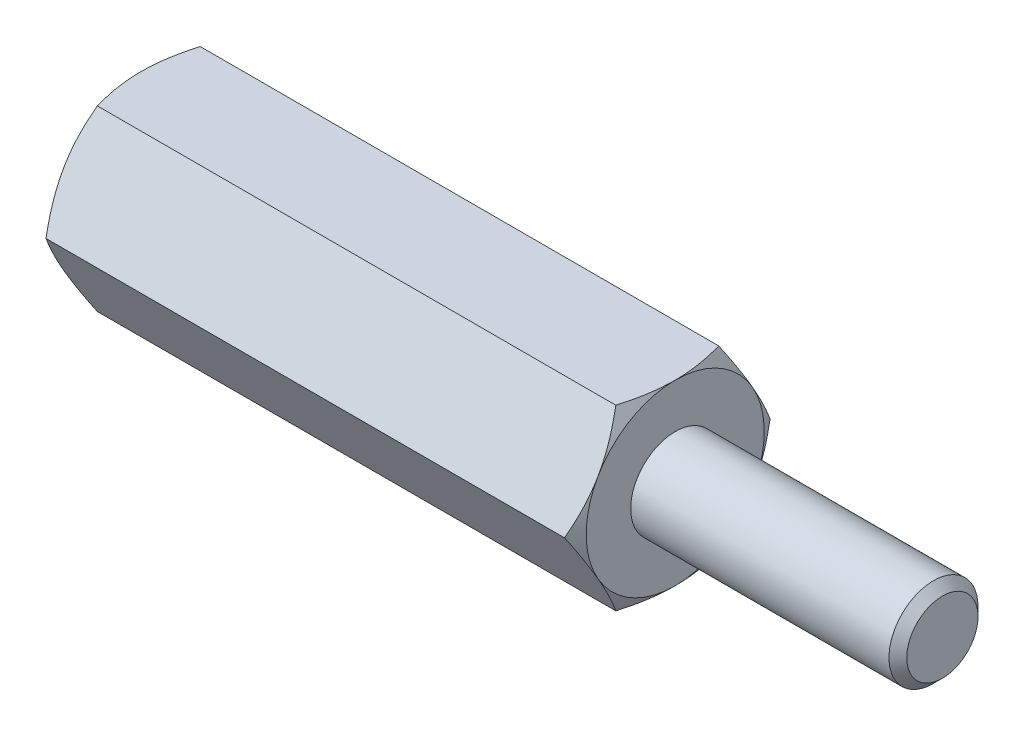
from build123d import *

# Parameters (mm, degrees)
EXTRUDE2_DEPTH = 6
SKETCH3_R      = 0.8
EXTRUDE3_DEPTH = 6
SKETCH5_R      = 1
EXTRUDE4_DEPTH = 6
CHAMFER1_SIZE  = 0.2


with BuildPart() as part:
    # Sketch1 → Extrude2 (new, symmetric)
    with BuildSketch(Plane(origin=(0, 0, 0), x_dir=(0, 0, -1), z_dir=(1, 0, 0))):
        Polygon((1.154700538, 2), (-1.154700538, 2), (-2.309401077, 0), (-1.154700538, -2), (1.154700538, -2), (2.309401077, 0), align=None)
    extrude(amount=EXTRUDE2_DEPTH, both=True)

    # Sketch2 → Cut-Revolve1 (revolve, cut)
    with BuildSketch(Plane.XY):
        with BuildLine():
            Line((-6, 2), (-4.5, 4.598076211))
            ThreePointArc((-4.5, 4.598076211), (-4.98810136, 5.776457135), (-6, 5))
            Line((-6, 5), (-6, 2))
        make_face()
    cut_revolve1 = revolve(axis=Axis((0, 0, 0), (1, 0, 0)), mode=Mode.SUBTRACT)

    # Mirror1: Cut-Revolve1 across plane
    add(cut_revolve1.mirror(Plane(origin=(0, 0, 0), x_dir=(0, 0, 1), z_dir=(1, 0, 0))), mode=Mode.SUBTRACT)

    # Sketch3 → Extrude3 (cut)
    with BuildSketch(Plane.ZY.offset(6)):
        Circle(SKETCH3_R)
    extrude(amount=-EXTRUDE3_DEPTH, mode=Mode.SUBTRACT)

    # Sketch4 → Cut-Revolve2 (revolve, cut)
    with BuildSketch(Plane.XY, mode=Mode.PRIVATE) as cut_revolve2_sk:
        Polygon((0, 0), (0, 0.8), (0.461880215, 0), align=None)
    revolve(cut_revolve2_sk.sketch.rotate(Axis((0.461880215, 0, 0), (-1, 0, 0)), 180), axis=Axis((0.461880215, 0, 0), (-1, 0, 0)), mode=Mode.SUBTRACT)

    # Sketch5 → Extrude4 (add)
    with BuildSketch(Plane(origin=(6, 0, 0), x_dir=(0, 0, -1), z_dir=(1, 0, 0))):
        Circle(SKETCH5_R)
    extrude(amount=EXTRUDE4_DEPTH)

    # Chamfer1
    chamfer1_edges = [part.edges().sort_by_distance(p)[0] for p in [
        (12, 0, 1),
    ]]
    chamfer(chamfer1_edges, length=CHAMFER1_SIZE)


solid = part.part
